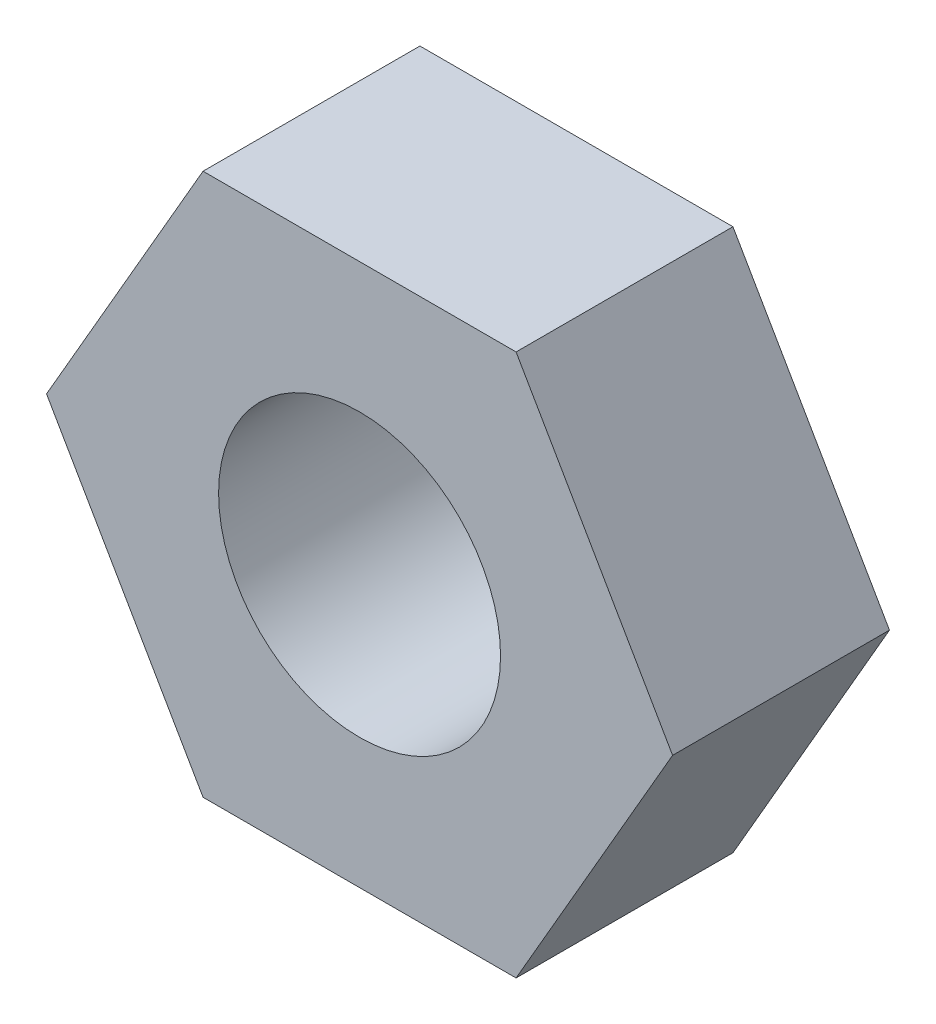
ISO-10303-21;
HEADER;
FILE_DESCRIPTION(('STEP AP214'),'2;1');
FILE_NAME('part.step','',(''),(''),'','','');
FILE_SCHEMA(('AUTOMOTIVE_DESIGN { 1 0 10303 214 1 1 1 1 }'));
ENDSEC;
DATA;
#1=APPLICATION_CONTEXT('core data for automotive mechanical design processes');
#2=APPLICATION_PROTOCOL_DEFINITION('international standard','automotive_design',2000,#1);
#3=PRODUCT_CONTEXT('',#1,'mechanical');
#4=PRODUCT('Part','Part','',(#3));
#5=PRODUCT_RELATED_PRODUCT_CATEGORY('part','',(#4));
#6=PRODUCT_DEFINITION_FORMATION('','',#4);
#7=PRODUCT_DEFINITION_CONTEXT('part definition',#1,'design');
#8=PRODUCT_DEFINITION('design','',#6,#7);
#9=PRODUCT_DEFINITION_SHAPE('','',#8);
#10=(LENGTH_UNIT() NAMED_UNIT(*) SI_UNIT(.MILLI.,.METRE.));
#11=(NAMED_UNIT(*) PLANE_ANGLE_UNIT() SI_UNIT($,.RADIAN.));
#12=(NAMED_UNIT(*) SI_UNIT($,.STERADIAN.) SOLID_ANGLE_UNIT());
#13=UNCERTAINTY_MEASURE_WITH_UNIT(LENGTH_MEASURE(1.E-05),#10,'distance_accuracy_value','');
#14=(GEOMETRIC_REPRESENTATION_CONTEXT(3) GLOBAL_UNCERTAINTY_ASSIGNED_CONTEXT((#13)) GLOBAL_UNIT_ASSIGNED_CONTEXT((#10,
#11,#12)) REPRESENTATION_CONTEXT('',''));
#15=CARTESIAN_POINT('',(0.,0.,0.));
#16=DIRECTION('',(0.,0.,1.));
#17=DIRECTION('',(1.,0.,0.));
#18=AXIS2_PLACEMENT_3D('',#15,#16,#17);
#19=CARTESIAN_POINT('',(0.,0.,2.54));
#20=DIRECTION('',(0.,0.,1.));
#21=DIRECTION('',(1.,0.,0.));
#22=AXIS2_PLACEMENT_3D('',#19,#20,#21);
#23=PLANE('',#22);
#24=DIRECTION('',(0.499999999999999,0.866025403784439,0.));
#25=VECTOR('',#24,1.);
#26=CARTESIAN_POINT('',(1.83308710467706,-3.175,2.54));
#27=LINE('',#26,#25);
#28=CARTESIAN_POINT('',(1.83308710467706,-3.175,2.54));
#29=VERTEX_POINT('',#28);
#30=CARTESIAN_POINT('',(3.66617420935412,0.,2.54));
#31=VERTEX_POINT('',#30);
#32=EDGE_CURVE('E152',#29,#31,#27,.T.);
#33=ORIENTED_EDGE('',*,*,#32,.T.);
#34=DIRECTION('',(-0.5,0.866025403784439,0.));
#35=VECTOR('',#34,1.);
#36=CARTESIAN_POINT('',(3.66617420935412,0.,2.54));
#37=LINE('',#36,#35);
#38=CARTESIAN_POINT('',(1.83308710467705,3.17500000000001,2.54));
#39=VERTEX_POINT('',#38);
#40=EDGE_CURVE('E100',#31,#39,#37,.T.);
#41=ORIENTED_EDGE('',*,*,#40,.T.);
#42=DIRECTION('',(-1.,0.,0.));
#43=VECTOR('',#42,1.);
#44=CARTESIAN_POINT('',(1.83308710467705,3.17500000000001,2.54));
#45=LINE('',#44,#43);
#46=CARTESIAN_POINT('',(-1.83308710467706,3.17500000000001,2.54));
#47=VERTEX_POINT('',#46);
#48=EDGE_CURVE('E113',#39,#47,#45,.T.);
#49=ORIENTED_EDGE('',*,*,#48,.T.);
#50=DIRECTION('',(-0.5,-0.866025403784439,0.));
#51=VECTOR('',#50,1.);
#52=CARTESIAN_POINT('',(-1.83308710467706,3.17500000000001,2.54));
#53=LINE('',#52,#51);
#54=CARTESIAN_POINT('',(-3.66617420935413,0.,2.54));
#55=VERTEX_POINT('',#54);
#56=EDGE_CURVE('E107',#47,#55,#53,.T.);
#57=ORIENTED_EDGE('',*,*,#56,.T.);
#58=DIRECTION('',(0.500000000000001,-0.866025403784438,0.));
#59=VECTOR('',#58,1.);
#60=CARTESIAN_POINT('',(-3.66617420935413,0.,2.54));
#61=LINE('',#60,#59);
#62=CARTESIAN_POINT('',(-1.83308710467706,-3.175,2.54));
#63=VERTEX_POINT('',#62);
#64=EDGE_CURVE('E111',#55,#63,#61,.T.);
#65=ORIENTED_EDGE('',*,*,#64,.T.);
#66=DIRECTION('',(1.,0.,0.));
#67=VECTOR('',#66,1.);
#68=CARTESIAN_POINT('',(-1.83308710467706,-3.175,2.54));
#69=LINE('',#68,#67);
#70=EDGE_CURVE('E63',#63,#29,#69,.T.);
#71=ORIENTED_EDGE('',*,*,#70,.T.);
#72=EDGE_LOOP('',(#33,#41,#49,#57,#65,#71));
#73=FACE_BOUND('',#72,.T.);
#74=CARTESIAN_POINT('',(0.,0.,2.54));
#75=DIRECTION('',(0.,0.,1.));
#76=DIRECTION('',(1.,0.,0.));
#77=AXIS2_PLACEMENT_3D('',#74,#75,#76);
#78=CIRCLE('',#77,1.651);
#79=CARTESIAN_POINT('',(1.651,0.,2.54));
#80=VERTEX_POINT('',#79);
#81=EDGE_CURVE('E140',#80,#80,#78,.T.);
#82=ORIENTED_EDGE('',*,*,#81,.F.);
#83=EDGE_LOOP('',(#82));
#84=FACE_BOUND('',#83,.T.);
#85=ADVANCED_FACE('F45',(#73,#84),#23,.T.);
#86=CARTESIAN_POINT('',(0.,0.,0.));
#87=DIRECTION('',(0.,0.,1.));
#88=DIRECTION('',(1.,0.,0.));
#89=AXIS2_PLACEMENT_3D('',#86,#87,#88);
#90=PLANE('',#89);
#91=DIRECTION('',(0.499999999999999,0.866025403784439,0.));
#92=VECTOR('',#91,1.);
#93=CARTESIAN_POINT('',(1.83308710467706,-3.175,0.));
#94=LINE('',#93,#92);
#95=CARTESIAN_POINT('',(1.83308710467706,-3.175,0.));
#96=VERTEX_POINT('',#95);
#97=CARTESIAN_POINT('',(3.66617420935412,0.,0.));
#98=VERTEX_POINT('',#97);
#99=EDGE_CURVE('E135',#96,#98,#94,.T.);
#100=ORIENTED_EDGE('',*,*,#99,.F.);
#101=DIRECTION('',(1.,0.,0.));
#102=VECTOR('',#101,1.);
#103=CARTESIAN_POINT('',(-1.83308710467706,-3.175,0.));
#104=LINE('',#103,#102);
#105=CARTESIAN_POINT('',(-1.83308710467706,-3.175,0.));
#106=VERTEX_POINT('',#105);
#107=EDGE_CURVE('E92',#106,#96,#104,.T.);
#108=ORIENTED_EDGE('',*,*,#107,.F.);
#109=DIRECTION('',(0.500000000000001,-0.866025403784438,0.));
#110=VECTOR('',#109,1.);
#111=CARTESIAN_POINT('',(-3.66617420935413,0.,0.));
#112=LINE('',#111,#110);
#113=CARTESIAN_POINT('',(-3.66617420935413,0.,0.));
#114=VERTEX_POINT('',#113);
#115=EDGE_CURVE('E86',#114,#106,#112,.T.);
#116=ORIENTED_EDGE('',*,*,#115,.F.);
#117=DIRECTION('',(-0.5,-0.866025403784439,0.));
#118=VECTOR('',#117,1.);
#119=CARTESIAN_POINT('',(-1.83308710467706,3.17500000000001,0.));
#120=LINE('',#119,#118);
#121=CARTESIAN_POINT('',(-1.83308710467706,3.17500000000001,0.));
#122=VERTEX_POINT('',#121);
#123=EDGE_CURVE('E122',#122,#114,#120,.T.);
#124=ORIENTED_EDGE('',*,*,#123,.F.);
#125=DIRECTION('',(-1.,0.,0.));
#126=VECTOR('',#125,1.);
#127=CARTESIAN_POINT('',(1.83308710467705,3.17500000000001,0.));
#128=LINE('',#127,#126);
#129=CARTESIAN_POINT('',(1.83308710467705,3.17500000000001,0.));
#130=VERTEX_POINT('',#129);
#131=EDGE_CURVE('E143',#130,#122,#128,.T.);
#132=ORIENTED_EDGE('',*,*,#131,.F.);
#133=DIRECTION('',(-0.5,0.866025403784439,0.));
#134=VECTOR('',#133,1.);
#135=CARTESIAN_POINT('',(3.66617420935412,0.,0.));
#136=LINE('',#135,#134);
#137=EDGE_CURVE('E139',#98,#130,#136,.T.);
#138=ORIENTED_EDGE('',*,*,#137,.F.);
#139=EDGE_LOOP('',(#100,#108,#116,#124,#132,#138));
#140=FACE_BOUND('',#139,.T.);
#141=CARTESIAN_POINT('',(0.,0.,0.));
#142=DIRECTION('',(0.,0.,1.));
#143=DIRECTION('',(1.,0.,0.));
#144=AXIS2_PLACEMENT_3D('',#141,#142,#143);
#145=CIRCLE('',#144,1.651);
#146=CARTESIAN_POINT('',(1.651,0.,0.));
#147=VERTEX_POINT('',#146);
#148=EDGE_CURVE('E249',#147,#147,#145,.T.);
#149=ORIENTED_EDGE('',*,*,#148,.T.);
#150=EDGE_LOOP('',(#149));
#151=FACE_BOUND('',#150,.T.);
#152=ADVANCED_FACE('F165',(#140,#151),#90,.F.);
#153=CARTESIAN_POINT('',(1.83308710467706,-3.175,2.54));
#154=DIRECTION('',(-0.866025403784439,0.499999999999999,0.));
#155=DIRECTION('',(-0.499999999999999,-0.866025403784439,0.));
#156=AXIS2_PLACEMENT_3D('',#153,#154,#155);
#157=PLANE('',#156);
#158=ORIENTED_EDGE('',*,*,#99,.T.);
#159=DIRECTION('',(0.,0.,-1.));
#160=VECTOR('',#159,1.);
#161=CARTESIAN_POINT('',(3.66617420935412,0.,2.54));
#162=LINE('',#161,#160);
#163=EDGE_CURVE('E11',#31,#98,#162,.T.);
#164=ORIENTED_EDGE('',*,*,#163,.F.);
#165=ORIENTED_EDGE('',*,*,#32,.F.);
#166=DIRECTION('',(0.,0.,-1.));
#167=VECTOR('',#166,1.);
#168=CARTESIAN_POINT('',(1.83308710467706,-3.175,2.54));
#169=LINE('',#168,#167);
#170=EDGE_CURVE('E131',#29,#96,#169,.T.);
#171=ORIENTED_EDGE('',*,*,#170,.T.);
#172=EDGE_LOOP('',(#158,#164,#165,#171));
#173=FACE_BOUND('',#172,.T.);
#174=ADVANCED_FACE('F47',(#173),#157,.F.);
#175=CARTESIAN_POINT('',(3.66617420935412,0.,2.54));
#176=DIRECTION('',(-0.866025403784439,-0.5,0.));
#177=DIRECTION('',(0.5,-0.866025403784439,0.));
#178=AXIS2_PLACEMENT_3D('',#175,#176,#177);
#179=PLANE('',#178);
#180=ORIENTED_EDGE('',*,*,#137,.T.);
#181=DIRECTION('',(0.,0.,-1.));
#182=VECTOR('',#181,1.);
#183=CARTESIAN_POINT('',(1.83308710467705,3.17500000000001,2.54));
#184=LINE('',#183,#182);
#185=EDGE_CURVE('E55',#39,#130,#184,.T.);
#186=ORIENTED_EDGE('',*,*,#185,.F.);
#187=ORIENTED_EDGE('',*,*,#40,.F.);
#188=ORIENTED_EDGE('',*,*,#163,.T.);
#189=EDGE_LOOP('',(#180,#186,#187,#188));
#190=FACE_BOUND('',#189,.T.);
#191=ADVANCED_FACE('F190',(#190),#179,.F.);
#192=CARTESIAN_POINT('',(1.83308710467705,3.17500000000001,2.54));
#193=DIRECTION('',(0.,-1.,0.));
#194=DIRECTION('',(0.,0.,-1.));
#195=AXIS2_PLACEMENT_3D('',#192,#193,#194);
#196=PLANE('',#195);
#197=ORIENTED_EDGE('',*,*,#131,.T.);
#198=DIRECTION('',(0.,0.,-1.));
#199=VECTOR('',#198,1.);
#200=CARTESIAN_POINT('',(-1.83308710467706,3.17500000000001,2.54));
#201=LINE('',#200,#199);
#202=EDGE_CURVE('E124',#47,#122,#201,.T.);
#203=ORIENTED_EDGE('',*,*,#202,.F.);
#204=ORIENTED_EDGE('',*,*,#48,.F.);
#205=ORIENTED_EDGE('',*,*,#185,.T.);
#206=EDGE_LOOP('',(#197,#203,#204,#205));
#207=FACE_BOUND('',#206,.T.);
#208=ADVANCED_FACE('F162',(#207),#196,.F.);
#209=CARTESIAN_POINT('',(-1.83308710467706,3.17500000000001,2.54));
#210=DIRECTION('',(0.866025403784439,-0.5,0.));
#211=DIRECTION('',(0.5,0.866025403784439,0.));
#212=AXIS2_PLACEMENT_3D('',#209,#210,#211);
#213=PLANE('',#212);
#214=ORIENTED_EDGE('',*,*,#123,.T.);
#215=DIRECTION('',(0.,0.,-1.));
#216=VECTOR('',#215,1.);
#217=CARTESIAN_POINT('',(-3.66617420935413,0.,2.54));
#218=LINE('',#217,#216);
#219=EDGE_CURVE('E119',#55,#114,#218,.T.);
#220=ORIENTED_EDGE('',*,*,#219,.F.);
#221=ORIENTED_EDGE('',*,*,#56,.F.);
#222=ORIENTED_EDGE('',*,*,#202,.T.);
#223=EDGE_LOOP('',(#214,#220,#221,#222));
#224=FACE_BOUND('',#223,.T.);
#225=ADVANCED_FACE('F120',(#224),#213,.F.);
#226=CARTESIAN_POINT('',(-3.66617420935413,0.,2.54));
#227=DIRECTION('',(0.866025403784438,0.500000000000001,0.));
#228=DIRECTION('',(-0.500000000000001,0.866025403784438,0.));
#229=AXIS2_PLACEMENT_3D('',#226,#227,#228);
#230=PLANE('',#229);
#231=ORIENTED_EDGE('',*,*,#115,.T.);
#232=DIRECTION('',(0.,0.,-1.));
#233=VECTOR('',#232,1.);
#234=CARTESIAN_POINT('',(-1.83308710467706,-3.175,2.54));
#235=LINE('',#234,#233);
#236=EDGE_CURVE('E125',#63,#106,#235,.T.);
#237=ORIENTED_EDGE('',*,*,#236,.F.);
#238=ORIENTED_EDGE('',*,*,#64,.F.);
#239=ORIENTED_EDGE('',*,*,#219,.T.);
#240=EDGE_LOOP('',(#231,#237,#238,#239));
#241=FACE_BOUND('',#240,.T.);
#242=ADVANCED_FACE('F127',(#241),#230,.F.);
#243=CARTESIAN_POINT('',(-1.83308710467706,-3.175,2.54));
#244=DIRECTION('',(0.,1.,0.));
#245=DIRECTION('',(0.,0.,1.));
#246=AXIS2_PLACEMENT_3D('',#243,#244,#245);
#247=PLANE('',#246);
#248=ORIENTED_EDGE('',*,*,#107,.T.);
#249=ORIENTED_EDGE('',*,*,#170,.F.);
#250=ORIENTED_EDGE('',*,*,#70,.F.);
#251=ORIENTED_EDGE('',*,*,#236,.T.);
#252=EDGE_LOOP('',(#248,#249,#250,#251));
#253=FACE_BOUND('',#252,.T.);
#254=ADVANCED_FACE('F170',(#253),#247,.F.);
#255=CARTESIAN_POINT('',(0.,0.,2.54));
#256=DIRECTION('',(0.,0.,-1.));
#257=DIRECTION('',(-1.,0.,0.));
#258=AXIS2_PLACEMENT_3D('',#255,#256,#257);
#259=CYLINDRICAL_SURFACE('',#258,1.651);
#260=ORIENTED_EDGE('',*,*,#81,.T.);
#261=EDGE_LOOP('',(#260));
#262=FACE_BOUND('',#261,.T.);
#263=ORIENTED_EDGE('',*,*,#148,.F.);
#264=EDGE_LOOP('',(#263));
#265=FACE_BOUND('',#264,.T.);
#266=ADVANCED_FACE('F172',(#262,#265),#259,.F.);
#267=CLOSED_SHELL('',(#85,#152,#174,#191,#208,#225,#242,#254,#266));
#268=MANIFOLD_SOLID_BREP('B2',#267);
#269=ADVANCED_BREP_SHAPE_REPRESENTATION('',(#18,#268),#14);
#270=SHAPE_DEFINITION_REPRESENTATION(#9,#269);
ENDSEC;
END-ISO-10303-21;
